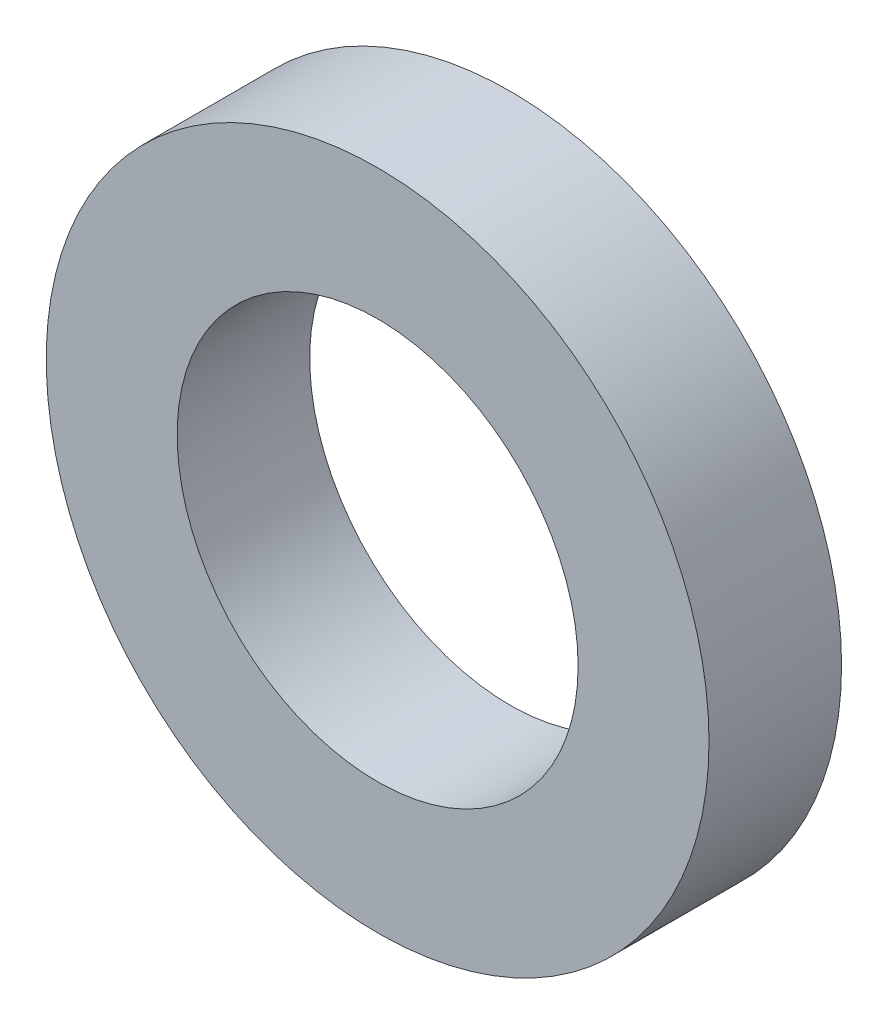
ISO-10303-21;
HEADER;
FILE_DESCRIPTION(('STEP AP214'),'2;1');
FILE_NAME('part.step','',(''),(''),'','','');
FILE_SCHEMA(('AUTOMOTIVE_DESIGN { 1 0 10303 214 1 1 1 1 }'));
ENDSEC;
DATA;
#1=APPLICATION_CONTEXT('core data for automotive mechanical design processes');
#2=APPLICATION_PROTOCOL_DEFINITION('international standard','automotive_design',2000,#1);
#3=PRODUCT_CONTEXT('',#1,'mechanical');
#4=PRODUCT('Part','Part','',(#3));
#5=PRODUCT_RELATED_PRODUCT_CATEGORY('part','',(#4));
#6=PRODUCT_DEFINITION_FORMATION('','',#4);
#7=PRODUCT_DEFINITION_CONTEXT('part definition',#1,'design');
#8=PRODUCT_DEFINITION('design','',#6,#7);
#9=PRODUCT_DEFINITION_SHAPE('','',#8);
#10=(LENGTH_UNIT() NAMED_UNIT(*) SI_UNIT(.MILLI.,.METRE.));
#11=(NAMED_UNIT(*) PLANE_ANGLE_UNIT() SI_UNIT($,.RADIAN.));
#12=(NAMED_UNIT(*) SI_UNIT($,.STERADIAN.) SOLID_ANGLE_UNIT());
#13=UNCERTAINTY_MEASURE_WITH_UNIT(LENGTH_MEASURE(1.E-05),#10,'distance_accuracy_value','');
#14=(GEOMETRIC_REPRESENTATION_CONTEXT(3) GLOBAL_UNCERTAINTY_ASSIGNED_CONTEXT((#13)) GLOBAL_UNIT_ASSIGNED_CONTEXT((#10,
#11,#12)) REPRESENTATION_CONTEXT('',''));
#15=CARTESIAN_POINT('',(0.,0.,0.));
#16=DIRECTION('',(0.,0.,1.));
#17=DIRECTION('',(1.,0.,0.));
#18=AXIS2_PLACEMENT_3D('',#15,#16,#17);
#19=CARTESIAN_POINT('',(0.,0.,4.));
#20=DIRECTION('',(0.,0.,1.));
#21=DIRECTION('',(1.,0.,0.));
#22=AXIS2_PLACEMENT_3D('',#19,#20,#21);
#23=PLANE('',#22);
#24=CARTESIAN_POINT('',(0.,0.,4.));
#25=DIRECTION('',(0.,0.,1.));
#26=DIRECTION('',(1.,0.,0.));
#27=AXIS2_PLACEMENT_3D('',#24,#25,#26);
#28=CIRCLE('',#27,10.);
#29=CARTESIAN_POINT('',(10.,0.,4.));
#30=VERTEX_POINT('',#29);
#31=EDGE_CURVE('E10',#30,#30,#28,.T.);
#32=ORIENTED_EDGE('',*,*,#31,.T.);
#33=EDGE_LOOP('',(#32));
#34=FACE_BOUND('',#33,.T.);
#35=CARTESIAN_POINT('',(0.,0.,4.));
#36=DIRECTION('',(0.,0.,1.));
#37=DIRECTION('',(1.,0.,0.));
#38=AXIS2_PLACEMENT_3D('',#35,#36,#37);
#39=CIRCLE('',#38,6.05);
#40=CARTESIAN_POINT('',(6.05,0.,4.));
#41=VERTEX_POINT('',#40);
#42=EDGE_CURVE('E50',#41,#41,#39,.T.);
#43=ORIENTED_EDGE('',*,*,#42,.F.);
#44=EDGE_LOOP('',(#43));
#45=FACE_BOUND('',#44,.T.);
#46=ADVANCED_FACE('F36',(#34,#45),#23,.T.);
#47=CARTESIAN_POINT('',(-9.43689570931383E-13,0.,0.));
#48=DIRECTION('',(0.,0.,1.));
#49=DIRECTION('',(1.,0.,0.));
#50=AXIS2_PLACEMENT_3D('',#47,#48,#49);
#51=PLANE('',#50);
#52=CARTESIAN_POINT('',(-9.43689570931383E-13,0.,0.));
#53=DIRECTION('',(0.,0.,1.));
#54=DIRECTION('',(1.,0.,0.));
#55=AXIS2_PLACEMENT_3D('',#52,#53,#54);
#56=CIRCLE('',#55,10.);
#57=CARTESIAN_POINT('',(9.99999999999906,0.,0.));
#58=VERTEX_POINT('',#57);
#59=EDGE_CURVE('E40',#58,#58,#56,.T.);
#60=ORIENTED_EDGE('',*,*,#59,.F.);
#61=EDGE_LOOP('',(#60));
#62=FACE_BOUND('',#61,.T.);
#63=CARTESIAN_POINT('',(-9.43689570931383E-13,0.,0.));
#64=DIRECTION('',(0.,0.,1.));
#65=DIRECTION('',(1.,0.,0.));
#66=AXIS2_PLACEMENT_3D('',#63,#64,#65);
#67=CIRCLE('',#66,6.05);
#68=CARTESIAN_POINT('',(6.04999999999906,0.,0.));
#69=VERTEX_POINT('',#68);
#70=EDGE_CURVE('E52',#69,#69,#67,.T.);
#71=ORIENTED_EDGE('',*,*,#70,.T.);
#72=EDGE_LOOP('',(#71));
#73=FACE_BOUND('',#72,.T.);
#74=ADVANCED_FACE('F63',(#62,#73),#51,.F.);
#75=CARTESIAN_POINT('',(0.,0.,4.));
#76=DIRECTION('',(0.,0.,-1.));
#77=DIRECTION('',(-1.,0.,0.));
#78=AXIS2_PLACEMENT_3D('',#75,#76,#77);
#79=CYLINDRICAL_SURFACE('',#78,10.);
#80=ORIENTED_EDGE('',*,*,#31,.F.);
#81=EDGE_LOOP('',(#80));
#82=FACE_BOUND('',#81,.T.);
#83=ORIENTED_EDGE('',*,*,#59,.T.);
#84=EDGE_LOOP('',(#83));
#85=FACE_BOUND('',#84,.T.);
#86=ADVANCED_FACE('F38',(#82,#85),#79,.T.);
#87=CARTESIAN_POINT('',(0.,0.,4.));
#88=DIRECTION('',(0.,0.,-1.));
#89=DIRECTION('',(-1.,0.,0.));
#90=AXIS2_PLACEMENT_3D('',#87,#88,#89);
#91=CYLINDRICAL_SURFACE('',#90,6.05);
#92=ORIENTED_EDGE('',*,*,#42,.T.);
#93=EDGE_LOOP('',(#92));
#94=FACE_BOUND('',#93,.T.);
#95=ORIENTED_EDGE('',*,*,#70,.F.);
#96=EDGE_LOOP('',(#95));
#97=FACE_BOUND('',#96,.T.);
#98=ADVANCED_FACE('F59',(#94,#97),#91,.F.);
#99=CLOSED_SHELL('',(#46,#74,#86,#98));
#100=MANIFOLD_SOLID_BREP('B2',#99);
#101=ADVANCED_BREP_SHAPE_REPRESENTATION('',(#18,#100),#14);
#102=SHAPE_DEFINITION_REPRESENTATION(#9,#101);
ENDSEC;
END-ISO-10303-21;
